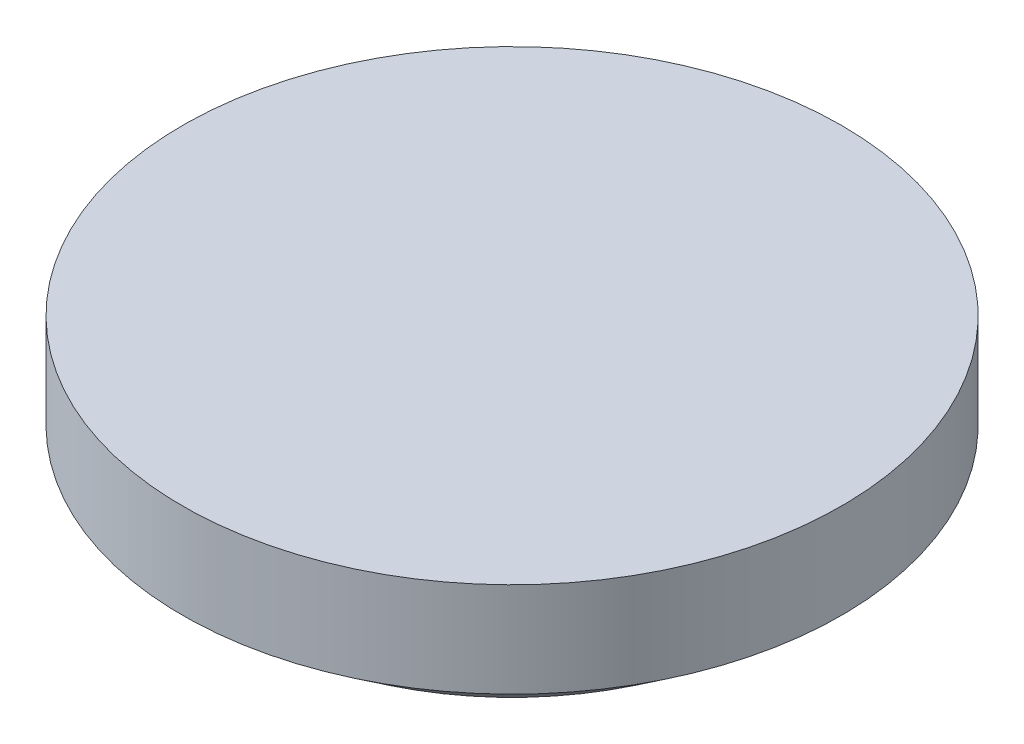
from build123d import *


with BuildPart() as part:
    # Sketch 1 → Revolve 1 (revolve)
    with BuildSketch(Plane.XY, mode=Mode.PRIVATE) as revolve_1_sk:
        Polygon((0, 350), (-800, 350), (-800, 120), (-640, 0), (0, 0), align=None)
    revolve(revolve_1_sk.sketch.rotate(Axis((0, 0, 0), (0, 1, 0)), 270), axis=Axis((0, 0, 0), (0, 1, 0)))


solid = part.part
